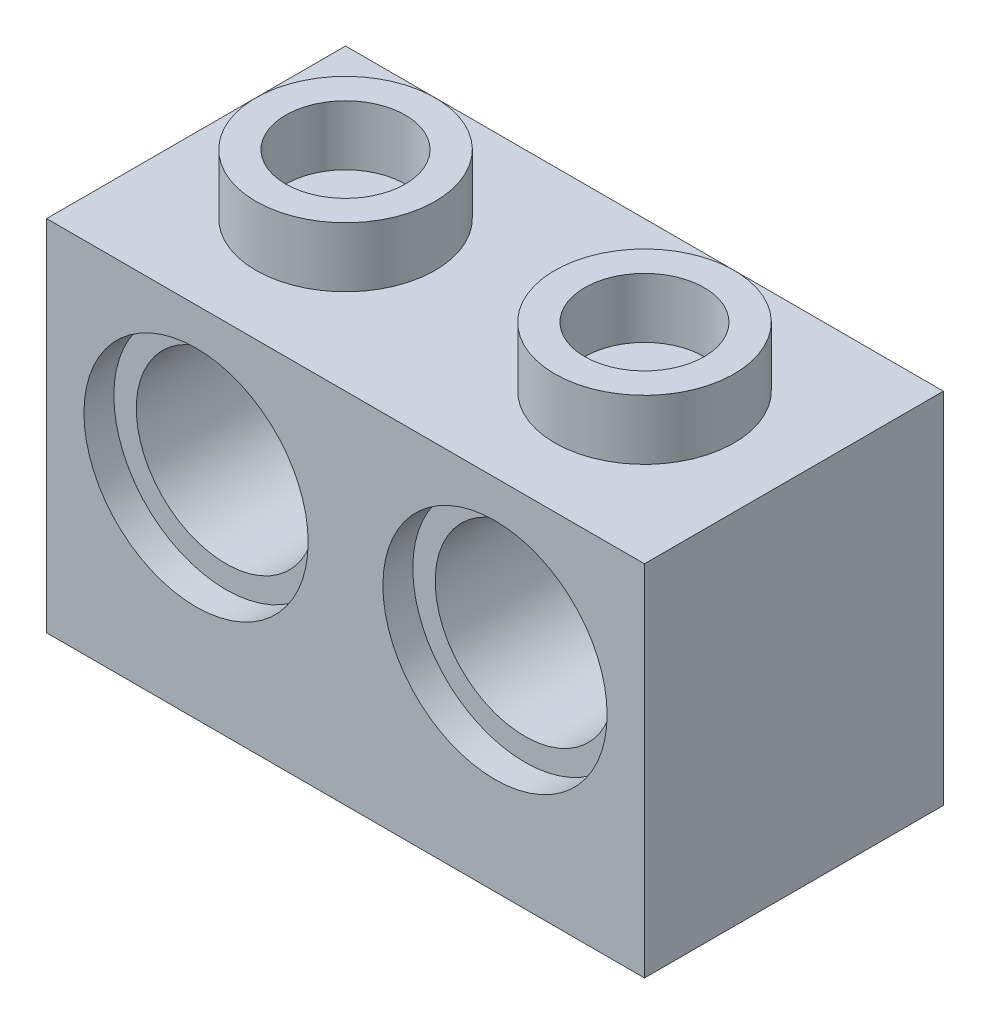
ISO-10303-21;
HEADER;
FILE_DESCRIPTION(('STEP AP214'),'2;1');
FILE_NAME('part.step','',(''),(''),'','','');
FILE_SCHEMA(('AUTOMOTIVE_DESIGN { 1 0 10303 214 1 1 1 1 }'));
ENDSEC;
DATA;
#1=APPLICATION_CONTEXT('core data for automotive mechanical design processes');
#2=APPLICATION_PROTOCOL_DEFINITION('international standard','automotive_design',2000,#1);
#3=PRODUCT_CONTEXT('',#1,'mechanical');
#4=PRODUCT('Part','Part','',(#3));
#5=PRODUCT_RELATED_PRODUCT_CATEGORY('part','',(#4));
#6=PRODUCT_DEFINITION_FORMATION('','',#4);
#7=PRODUCT_DEFINITION_CONTEXT('part definition',#1,'design');
#8=PRODUCT_DEFINITION('design','',#6,#7);
#9=PRODUCT_DEFINITION_SHAPE('','',#8);
#10=(LENGTH_UNIT() NAMED_UNIT(*) SI_UNIT(.MILLI.,.METRE.));
#11=(NAMED_UNIT(*) PLANE_ANGLE_UNIT() SI_UNIT($,.RADIAN.));
#12=(NAMED_UNIT(*) SI_UNIT($,.STERADIAN.) SOLID_ANGLE_UNIT());
#13=UNCERTAINTY_MEASURE_WITH_UNIT(LENGTH_MEASURE(1.E-05),#10,'distance_accuracy_value','');
#14=(GEOMETRIC_REPRESENTATION_CONTEXT(3) GLOBAL_UNCERTAINTY_ASSIGNED_CONTEXT((#13)) GLOBAL_UNIT_ASSIGNED_CONTEXT((#10,
#11,#12)) REPRESENTATION_CONTEXT('',''));
#15=CARTESIAN_POINT('',(0.,0.,0.));
#16=DIRECTION('',(0.,0.,1.));
#17=DIRECTION('',(1.,0.,0.));
#18=AXIS2_PLACEMENT_3D('',#15,#16,#17);
#19=CARTESIAN_POINT('',(3.99999999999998,0.80000000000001,-4.));
#20=DIRECTION('',(0.,0.,1.));
#21=DIRECTION('',(1.,0.,0.));
#22=AXIS2_PLACEMENT_3D('',#19,#20,#21);
#23=CYLINDRICAL_SURFACE('',#22,2.4);
#24=CARTESIAN_POINT('',(3.99999999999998,0.80000000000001,3.2));
#25=DIRECTION('',(0.,0.,1.));
#26=DIRECTION('',(1.,0.,0.));
#27=AXIS2_PLACEMENT_3D('',#24,#25,#26);
#28=CIRCLE('',#27,2.4);
#29=CARTESIAN_POINT('',(6.39999999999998,0.80000000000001,3.2));
#30=VERTEX_POINT('',#29);
#31=EDGE_CURVE('E207',#30,#30,#28,.F.);
#32=ORIENTED_EDGE('',*,*,#31,.F.);
#33=EDGE_LOOP('',(#32));
#34=FACE_BOUND('',#33,.T.);
#35=CARTESIAN_POINT('',(3.99999999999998,0.80000000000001,-3.2));
#36=DIRECTION('',(0.,0.,-1.));
#37=DIRECTION('',(-1.,0.,0.));
#38=AXIS2_PLACEMENT_3D('',#35,#36,#37);
#39=CIRCLE('',#38,2.4);
#40=CARTESIAN_POINT('',(1.59999999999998,0.80000000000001,-3.2));
#41=VERTEX_POINT('',#40);
#42=EDGE_CURVE('E42',#41,#41,#39,.F.);
#43=ORIENTED_EDGE('',*,*,#42,.F.);
#44=EDGE_LOOP('',(#43));
#45=FACE_BOUND('',#44,.T.);
#46=ADVANCED_FACE('F38',(#34,#45),#23,.F.);
#47=CARTESIAN_POINT('',(-4.00000000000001,0.80000000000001,-4.));
#48=DIRECTION('',(0.,0.,1.));
#49=DIRECTION('',(1.,0.,0.));
#50=AXIS2_PLACEMENT_3D('',#47,#48,#49);
#51=CYLINDRICAL_SURFACE('',#50,2.4);
#52=CARTESIAN_POINT('',(-4.00000000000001,0.80000000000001,3.2));
#53=DIRECTION('',(0.,0.,1.));
#54=DIRECTION('',(1.,0.,0.));
#55=AXIS2_PLACEMENT_3D('',#52,#53,#54);
#56=CIRCLE('',#55,2.4);
#57=CARTESIAN_POINT('',(-1.60000000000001,0.80000000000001,3.2));
#58=VERTEX_POINT('',#57);
#59=EDGE_CURVE('E204',#58,#58,#56,.F.);
#60=ORIENTED_EDGE('',*,*,#59,.F.);
#61=EDGE_LOOP('',(#60));
#62=FACE_BOUND('',#61,.T.);
#63=CARTESIAN_POINT('',(-4.00000000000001,0.80000000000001,-3.2));
#64=DIRECTION('',(0.,0.,-1.));
#65=DIRECTION('',(-1.,0.,0.));
#66=AXIS2_PLACEMENT_3D('',#63,#64,#65);
#67=CIRCLE('',#66,2.4);
#68=CARTESIAN_POINT('',(-6.40000000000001,0.80000000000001,-3.2));
#69=VERTEX_POINT('',#68);
#70=EDGE_CURVE('E210',#69,#69,#67,.F.);
#71=ORIENTED_EDGE('',*,*,#70,.F.);
#72=EDGE_LOOP('',(#71));
#73=FACE_BOUND('',#72,.T.);
#74=ADVANCED_FACE('F267',(#62,#73),#51,.F.);
#75=CARTESIAN_POINT('',(7.99999999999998,-4.79999999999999,-4.));
#76=DIRECTION('',(1.,0.,0.));
#77=DIRECTION('',(0.,0.,-1.));
#78=AXIS2_PLACEMENT_3D('',#75,#76,#77);
#79=PLANE('',#78);
#80=DIRECTION('',(0.,0.,1.));
#81=VECTOR('',#80,1.);
#82=CARTESIAN_POINT('',(7.99999999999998,4.80000000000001,-4.));
#83=LINE('',#82,#81);
#84=CARTESIAN_POINT('',(7.99999999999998,4.80000000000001,-4.));
#85=VERTEX_POINT('',#84);
#86=CARTESIAN_POINT('',(7.99999999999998,4.80000000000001,4.));
#87=VERTEX_POINT('',#86);
#88=EDGE_CURVE('E195',#85,#87,#83,.T.);
#89=ORIENTED_EDGE('',*,*,#88,.T.);
#90=DIRECTION('',(0.,1.,0.));
#91=VECTOR('',#90,1.);
#92=CARTESIAN_POINT('',(7.99999999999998,-4.79999999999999,4.));
#93=LINE('',#92,#91);
#94=CARTESIAN_POINT('',(7.99999999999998,-4.79999999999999,4.));
#95=VERTEX_POINT('',#94);
#96=EDGE_CURVE('E170',#95,#87,#93,.T.);
#97=ORIENTED_EDGE('',*,*,#96,.F.);
#98=DIRECTION('',(0.,0.,1.));
#99=VECTOR('',#98,1.);
#100=CARTESIAN_POINT('',(7.99999999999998,-4.79999999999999,-4.));
#101=LINE('',#100,#99);
#102=CARTESIAN_POINT('',(7.99999999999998,-4.79999999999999,-4.));
#103=VERTEX_POINT('',#102);
#104=EDGE_CURVE('E63',#103,#95,#101,.T.);
#105=ORIENTED_EDGE('',*,*,#104,.F.);
#106=DIRECTION('',(0.,1.,0.));
#107=VECTOR('',#106,1.);
#108=CARTESIAN_POINT('',(7.99999999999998,-4.79999999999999,-4.));
#109=LINE('',#108,#107);
#110=EDGE_CURVE('E184',#103,#85,#109,.T.);
#111=ORIENTED_EDGE('',*,*,#110,.T.);
#112=EDGE_LOOP('',(#89,#97,#105,#111));
#113=FACE_BOUND('',#112,.T.);
#114=ADVANCED_FACE('F40',(#113),#79,.T.);
#115=CARTESIAN_POINT('',(-8.00000000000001,-4.79999999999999,-4.));
#116=DIRECTION('',(0.,-1.,0.));
#117=DIRECTION('',(0.,0.,-1.));
#118=AXIS2_PLACEMENT_3D('',#115,#116,#117);
#119=PLANE('',#118);
#120=DIRECTION('',(0.,0.,1.));
#121=VECTOR('',#120,1.);
#122=CARTESIAN_POINT('',(6.39999999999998,-4.79999999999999,-4.));
#123=LINE('',#122,#121);
#124=CARTESIAN_POINT('',(6.39999999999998,-4.79999999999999,-2.4));
#125=VERTEX_POINT('',#124);
#126=CARTESIAN_POINT('',(6.39999999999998,-4.79999999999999,2.4));
#127=VERTEX_POINT('',#126);
#128=EDGE_CURVE('E114',#125,#127,#123,.T.);
#129=ORIENTED_EDGE('',*,*,#128,.F.);
#130=DIRECTION('',(1.,0.,0.));
#131=VECTOR('',#130,1.);
#132=CARTESIAN_POINT('',(-8.00000000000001,-4.79999999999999,-2.4));
#133=LINE('',#132,#131);
#134=CARTESIAN_POINT('',(-6.40000000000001,-4.79999999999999,-2.4));
#135=VERTEX_POINT('',#134);
#136=EDGE_CURVE('E147',#135,#125,#133,.T.);
#137=ORIENTED_EDGE('',*,*,#136,.F.);
#138=DIRECTION('',(0.,0.,1.));
#139=VECTOR('',#138,1.);
#140=CARTESIAN_POINT('',(-6.40000000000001,-4.79999999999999,-4.));
#141=LINE('',#140,#139);
#142=CARTESIAN_POINT('',(-6.40000000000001,-4.79999999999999,2.4));
#143=VERTEX_POINT('',#142);
#144=EDGE_CURVE('E124',#135,#143,#141,.T.);
#145=ORIENTED_EDGE('',*,*,#144,.T.);
#146=DIRECTION('',(1.,0.,0.));
#147=VECTOR('',#146,1.);
#148=CARTESIAN_POINT('',(-8.00000000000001,-4.79999999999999,2.4));
#149=LINE('',#148,#147);
#150=EDGE_CURVE('E131',#143,#127,#149,.T.);
#151=ORIENTED_EDGE('',*,*,#150,.T.);
#152=EDGE_LOOP('',(#129,#137,#145,#151));
#153=FACE_BOUND('',#152,.T.);
#154=ORIENTED_EDGE('',*,*,#104,.T.);
#155=DIRECTION('',(1.,0.,0.));
#156=VECTOR('',#155,1.);
#157=CARTESIAN_POINT('',(-8.00000000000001,-4.79999999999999,4.));
#158=LINE('',#157,#156);
#159=CARTESIAN_POINT('',(-8.00000000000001,-4.79999999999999,4.));
#160=VERTEX_POINT('',#159);
#161=EDGE_CURVE('E181',#160,#95,#158,.T.);
#162=ORIENTED_EDGE('',*,*,#161,.F.);
#163=DIRECTION('',(0.,0.,1.));
#164=VECTOR('',#163,1.);
#165=CARTESIAN_POINT('',(-8.00000000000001,-4.79999999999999,-4.));
#166=LINE('',#165,#164);
#167=CARTESIAN_POINT('',(-8.00000000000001,-4.79999999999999,-4.));
#168=VERTEX_POINT('',#167);
#169=EDGE_CURVE('E197',#168,#160,#166,.T.);
#170=ORIENTED_EDGE('',*,*,#169,.F.);
#171=DIRECTION('',(1.,0.,0.));
#172=VECTOR('',#171,1.);
#173=CARTESIAN_POINT('',(-8.00000000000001,-4.79999999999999,-4.));
#174=LINE('',#173,#172);
#175=EDGE_CURVE('E192',#168,#103,#174,.T.);
#176=ORIENTED_EDGE('',*,*,#175,.T.);
#177=EDGE_LOOP('',(#154,#162,#170,#176));
#178=FACE_BOUND('',#177,.T.);
#179=ADVANCED_FACE('F139',(#153,#178),#119,.T.);
#180=CARTESIAN_POINT('',(-8.00000000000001,-4.79999999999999,-4.));
#181=DIRECTION('',(-1.,0.,0.));
#182=DIRECTION('',(0.,0.,1.));
#183=AXIS2_PLACEMENT_3D('',#180,#181,#182);
#184=PLANE('',#183);
#185=ORIENTED_EDGE('',*,*,#169,.T.);
#186=DIRECTION('',(0.,-1.,0.));
#187=VECTOR('',#186,1.);
#188=CARTESIAN_POINT('',(-8.00000000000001,-4.79999999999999,4.));
#189=LINE('',#188,#187);
#190=CARTESIAN_POINT('',(-8.00000000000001,4.80000000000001,4.));
#191=VERTEX_POINT('',#190);
#192=EDGE_CURVE('E178',#191,#160,#189,.T.);
#193=ORIENTED_EDGE('',*,*,#192,.F.);
#194=DIRECTION('',(0.,0.,1.));
#195=VECTOR('',#194,1.);
#196=CARTESIAN_POINT('',(-8.00000000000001,4.80000000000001,-4.));
#197=LINE('',#196,#195);
#198=CARTESIAN_POINT('',(-8.00000000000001,4.80000000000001,-4.));
#199=VERTEX_POINT('',#198);
#200=EDGE_CURVE('E199',#199,#191,#197,.T.);
#201=ORIENTED_EDGE('',*,*,#200,.F.);
#202=DIRECTION('',(0.,-1.,0.));
#203=VECTOR('',#202,1.);
#204=CARTESIAN_POINT('',(-8.00000000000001,-4.79999999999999,-4.));
#205=LINE('',#204,#203);
#206=EDGE_CURVE('E189',#199,#168,#205,.T.);
#207=ORIENTED_EDGE('',*,*,#206,.T.);
#208=EDGE_LOOP('',(#185,#193,#201,#207));
#209=FACE_BOUND('',#208,.T.);
#210=ADVANCED_FACE('F316',(#209),#184,.T.);
#211=CARTESIAN_POINT('',(-8.00000000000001,4.80000000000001,-4.));
#212=DIRECTION('',(0.,1.,0.));
#213=DIRECTION('',(0.,0.,1.));
#214=AXIS2_PLACEMENT_3D('',#211,#212,#213);
#215=PLANE('',#214);
#216=CARTESIAN_POINT('',(3.99999999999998,4.80000000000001,0.));
#217=DIRECTION('',(0.,1.,0.));
#218=DIRECTION('',(0.,0.,1.));
#219=AXIS2_PLACEMENT_3D('',#216,#217,#218);
#220=CIRCLE('',#219,2.4);
#221=CARTESIAN_POINT('',(3.99999999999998,4.80000000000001,2.4));
#222=VERTEX_POINT('',#221);
#223=EDGE_CURVE('E157',#222,#222,#220,.T.);
#224=ORIENTED_EDGE('',*,*,#223,.F.);
#225=EDGE_LOOP('',(#224));
#226=FACE_BOUND('',#225,.T.);
#227=CARTESIAN_POINT('',(-4.00000000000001,4.80000000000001,0.));
#228=DIRECTION('',(0.,1.,0.));
#229=DIRECTION('',(0.,0.,1.));
#230=AXIS2_PLACEMENT_3D('',#227,#228,#229);
#231=CIRCLE('',#230,2.4);
#232=CARTESIAN_POINT('',(-4.00000000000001,4.80000000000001,2.4));
#233=VERTEX_POINT('',#232);
#234=EDGE_CURVE('E166',#233,#233,#231,.T.);
#235=ORIENTED_EDGE('',*,*,#234,.F.);
#236=EDGE_LOOP('',(#235));
#237=FACE_BOUND('',#236,.T.);
#238=ORIENTED_EDGE('',*,*,#200,.T.);
#239=DIRECTION('',(-1.,0.,0.));
#240=VECTOR('',#239,1.);
#241=CARTESIAN_POINT('',(-8.00000000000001,4.80000000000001,4.));
#242=LINE('',#241,#240);
#243=EDGE_CURVE('E175',#87,#191,#242,.T.);
#244=ORIENTED_EDGE('',*,*,#243,.F.);
#245=ORIENTED_EDGE('',*,*,#88,.F.);
#246=DIRECTION('',(-1.,0.,0.));
#247=VECTOR('',#246,1.);
#248=CARTESIAN_POINT('',(-8.00000000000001,4.80000000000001,-4.));
#249=LINE('',#248,#247);
#250=EDGE_CURVE('E186',#85,#199,#249,.T.);
#251=ORIENTED_EDGE('',*,*,#250,.T.);
#252=EDGE_LOOP('',(#238,#244,#245,#251));
#253=FACE_BOUND('',#252,.T.);
#254=ADVANCED_FACE('F312',(#226,#237,#253),#215,.T.);
#255=CARTESIAN_POINT('',(0.,0.,-4.));
#256=DIRECTION('',(0.,0.,-1.));
#257=DIRECTION('',(-1.,0.,0.));
#258=AXIS2_PLACEMENT_3D('',#255,#256,#257);
#259=PLANE('',#258);
#260=CARTESIAN_POINT('',(-4.00000000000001,0.80000000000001,-4.));
#261=DIRECTION('',(0.,0.,1.));
#262=DIRECTION('',(1.,0.,0.));
#263=AXIS2_PLACEMENT_3D('',#260,#261,#262);
#264=CIRCLE('',#263,3.);
#265=CARTESIAN_POINT('',(-1.00000000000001,0.80000000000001,-4.));
#266=VERTEX_POINT('',#265);
#267=EDGE_CURVE('E218',#266,#266,#264,.T.);
#268=ORIENTED_EDGE('',*,*,#267,.T.);
#269=EDGE_LOOP('',(#268));
#270=FACE_BOUND('',#269,.T.);
#271=CARTESIAN_POINT('',(3.99999999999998,0.80000000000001,-4.));
#272=DIRECTION('',(0.,0.,1.));
#273=DIRECTION('',(1.,0.,0.));
#274=AXIS2_PLACEMENT_3D('',#271,#272,#273);
#275=CIRCLE('',#274,3.);
#276=CARTESIAN_POINT('',(6.99999999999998,0.80000000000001,-4.));
#277=VERTEX_POINT('',#276);
#278=EDGE_CURVE('E228',#277,#277,#275,.T.);
#279=ORIENTED_EDGE('',*,*,#278,.T.);
#280=EDGE_LOOP('',(#279));
#281=FACE_BOUND('',#280,.T.);
#282=ORIENTED_EDGE('',*,*,#110,.F.);
#283=ORIENTED_EDGE('',*,*,#175,.F.);
#284=ORIENTED_EDGE('',*,*,#206,.F.);
#285=ORIENTED_EDGE('',*,*,#250,.F.);
#286=EDGE_LOOP('',(#282,#283,#284,#285));
#287=FACE_BOUND('',#286,.T.);
#288=ADVANCED_FACE('F308',(#270,#281,#287),#259,.T.);
#289=CARTESIAN_POINT('',(0.,0.,4.));
#290=DIRECTION('',(0.,0.,-1.));
#291=DIRECTION('',(-1.,0.,0.));
#292=AXIS2_PLACEMENT_3D('',#289,#290,#291);
#293=PLANE('',#292);
#294=CARTESIAN_POINT('',(-4.00000000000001,0.80000000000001,4.));
#295=DIRECTION('',(0.,0.,1.));
#296=DIRECTION('',(1.,0.,0.));
#297=AXIS2_PLACEMENT_3D('',#294,#295,#296);
#298=CIRCLE('',#297,3.);
#299=CARTESIAN_POINT('',(-1.00000000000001,0.80000000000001,4.));
#300=VERTEX_POINT('',#299);
#301=EDGE_CURVE('E233',#300,#300,#298,.T.);
#302=ORIENTED_EDGE('',*,*,#301,.F.);
#303=EDGE_LOOP('',(#302));
#304=FACE_BOUND('',#303,.T.);
#305=CARTESIAN_POINT('',(3.99999999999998,0.80000000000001,4.));
#306=DIRECTION('',(0.,0.,1.));
#307=DIRECTION('',(1.,0.,0.));
#308=AXIS2_PLACEMENT_3D('',#305,#306,#307);
#309=CIRCLE('',#308,3.);
#310=CARTESIAN_POINT('',(6.99999999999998,0.80000000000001,4.));
#311=VERTEX_POINT('',#310);
#312=EDGE_CURVE('E216',#311,#311,#309,.T.);
#313=ORIENTED_EDGE('',*,*,#312,.F.);
#314=EDGE_LOOP('',(#313));
#315=FACE_BOUND('',#314,.T.);
#316=ORIENTED_EDGE('',*,*,#96,.T.);
#317=ORIENTED_EDGE('',*,*,#243,.T.);
#318=ORIENTED_EDGE('',*,*,#192,.T.);
#319=ORIENTED_EDGE('',*,*,#161,.T.);
#320=EDGE_LOOP('',(#316,#317,#318,#319));
#321=FACE_BOUND('',#320,.T.);
#322=ADVANCED_FACE('F301',(#304,#315,#321),#293,.F.);
#323=CARTESIAN_POINT('',(-4.00000000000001,6.40000000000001,0.));
#324=DIRECTION('',(0.,1.,0.));
#325=DIRECTION('',(0.,0.,1.));
#326=AXIS2_PLACEMENT_3D('',#323,#324,#325);
#327=PLANE('',#326);
#328=CARTESIAN_POINT('',(-4.00000000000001,6.40000000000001,0.));
#329=DIRECTION('',(0.,1.,0.));
#330=DIRECTION('',(0.,0.,1.));
#331=AXIS2_PLACEMENT_3D('',#328,#329,#330);
#332=CIRCLE('',#331,2.4);
#333=CARTESIAN_POINT('',(-4.00000000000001,6.40000000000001,2.4));
#334=VERTEX_POINT('',#333);
#335=EDGE_CURVE('E167',#334,#334,#332,.T.);
#336=ORIENTED_EDGE('',*,*,#335,.T.);
#337=EDGE_LOOP('',(#336));
#338=FACE_BOUND('',#337,.T.);
#339=CARTESIAN_POINT('',(-4.00000000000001,6.40000000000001,0.));
#340=DIRECTION('',(0.,1.,0.));
#341=DIRECTION('',(0.,0.,1.));
#342=AXIS2_PLACEMENT_3D('',#339,#340,#341);
#343=CIRCLE('',#342,1.6);
#344=CARTESIAN_POINT('',(-4.00000000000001,6.40000000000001,1.6));
#345=VERTEX_POINT('',#344);
#346=EDGE_CURVE('E161',#345,#345,#343,.T.);
#347=ORIENTED_EDGE('',*,*,#346,.F.);
#348=EDGE_LOOP('',(#347));
#349=FACE_BOUND('',#348,.T.);
#350=ADVANCED_FACE('F298',(#338,#349),#327,.T.);
#351=CARTESIAN_POINT('',(-4.00000000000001,6.40000000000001,0.));
#352=DIRECTION('',(0.,-1.,0.));
#353=DIRECTION('',(0.,0.,-1.));
#354=AXIS2_PLACEMENT_3D('',#351,#352,#353);
#355=CYLINDRICAL_SURFACE('',#354,2.4);
#356=ORIENTED_EDGE('',*,*,#335,.F.);
#357=EDGE_LOOP('',(#356));
#358=FACE_BOUND('',#357,.T.);
#359=ORIENTED_EDGE('',*,*,#234,.T.);
#360=EDGE_LOOP('',(#359));
#361=FACE_BOUND('',#360,.T.);
#362=ADVANCED_FACE('F296',(#358,#361),#355,.T.);
#363=CARTESIAN_POINT('',(-4.00000000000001,6.40000000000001,0.));
#364=DIRECTION('',(0.,-1.,0.));
#365=DIRECTION('',(0.,0.,-1.));
#366=AXIS2_PLACEMENT_3D('',#363,#364,#365);
#367=CYLINDRICAL_SURFACE('',#366,1.6);
#368=ORIENTED_EDGE('',*,*,#346,.T.);
#369=EDGE_LOOP('',(#368));
#370=FACE_BOUND('',#369,.T.);
#371=CARTESIAN_POINT('',(-4.00000000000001,4.80000000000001,0.));
#372=DIRECTION('',(0.,1.,0.));
#373=DIRECTION('',(0.,0.,1.));
#374=AXIS2_PLACEMENT_3D('',#371,#372,#373);
#375=CIRCLE('',#374,1.6);
#376=CARTESIAN_POINT('',(-4.00000000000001,4.80000000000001,1.6));
#377=VERTEX_POINT('',#376);
#378=EDGE_CURVE('E47',#377,#377,#375,.F.);
#379=ORIENTED_EDGE('',*,*,#378,.T.);
#380=EDGE_LOOP('',(#379));
#381=FACE_BOUND('',#380,.T.);
#382=ADVANCED_FACE('F293',(#370,#381),#367,.F.);
#383=ORIENTED_EDGE('',*,*,#378,.F.);
#384=EDGE_LOOP('',(#383));
#385=FACE_BOUND('',#384,.T.);
#386=ADVANCED_FACE('F288',(#385),#215,.T.);
#387=CARTESIAN_POINT('',(3.99999999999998,6.40000000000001,0.));
#388=DIRECTION('',(0.,1.,0.));
#389=DIRECTION('',(0.,0.,1.));
#390=AXIS2_PLACEMENT_3D('',#387,#388,#389);
#391=PLANE('',#390);
#392=CARTESIAN_POINT('',(3.99999999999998,6.40000000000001,0.));
#393=DIRECTION('',(0.,1.,0.));
#394=DIRECTION('',(0.,0.,1.));
#395=AXIS2_PLACEMENT_3D('',#392,#393,#394);
#396=CIRCLE('',#395,2.4);
#397=CARTESIAN_POINT('',(3.99999999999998,6.40000000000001,2.4));
#398=VERTEX_POINT('',#397);
#399=EDGE_CURVE('E158',#398,#398,#396,.T.);
#400=ORIENTED_EDGE('',*,*,#399,.T.);
#401=EDGE_LOOP('',(#400));
#402=FACE_BOUND('',#401,.T.);
#403=CARTESIAN_POINT('',(3.99999999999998,6.40000000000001,0.));
#404=DIRECTION('',(0.,1.,0.));
#405=DIRECTION('',(0.,0.,1.));
#406=AXIS2_PLACEMENT_3D('',#403,#404,#405);
#407=CIRCLE('',#406,1.6);
#408=CARTESIAN_POINT('',(3.99999999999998,6.40000000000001,1.6));
#409=VERTEX_POINT('',#408);
#410=EDGE_CURVE('E154',#409,#409,#407,.T.);
#411=ORIENTED_EDGE('',*,*,#410,.F.);
#412=EDGE_LOOP('',(#411));
#413=FACE_BOUND('',#412,.T.);
#414=ADVANCED_FACE('F285',(#402,#413),#391,.T.);
#415=CARTESIAN_POINT('',(3.99999999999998,6.40000000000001,0.));
#416=DIRECTION('',(0.,-1.,0.));
#417=DIRECTION('',(0.,0.,-1.));
#418=AXIS2_PLACEMENT_3D('',#415,#416,#417);
#419=CYLINDRICAL_SURFACE('',#418,2.4);
#420=ORIENTED_EDGE('',*,*,#399,.F.);
#421=EDGE_LOOP('',(#420));
#422=FACE_BOUND('',#421,.T.);
#423=ORIENTED_EDGE('',*,*,#223,.T.);
#424=EDGE_LOOP('',(#423));
#425=FACE_BOUND('',#424,.T.);
#426=ADVANCED_FACE('F283',(#422,#425),#419,.T.);
#427=CARTESIAN_POINT('',(3.99999999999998,6.40000000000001,0.));
#428=DIRECTION('',(0.,-1.,0.));
#429=DIRECTION('',(0.,0.,-1.));
#430=AXIS2_PLACEMENT_3D('',#427,#428,#429);
#431=CYLINDRICAL_SURFACE('',#430,1.6);
#432=ORIENTED_EDGE('',*,*,#410,.T.);
#433=EDGE_LOOP('',(#432));
#434=FACE_BOUND('',#433,.T.);
#435=CARTESIAN_POINT('',(3.99999999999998,4.80000000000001,0.));
#436=DIRECTION('',(0.,1.,0.));
#437=DIRECTION('',(0.,0.,1.));
#438=AXIS2_PLACEMENT_3D('',#435,#436,#437);
#439=CIRCLE('',#438,1.6);
#440=CARTESIAN_POINT('',(3.99999999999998,4.80000000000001,1.6));
#441=VERTEX_POINT('',#440);
#442=EDGE_CURVE('E11',#441,#441,#439,.F.);
#443=ORIENTED_EDGE('',*,*,#442,.T.);
#444=EDGE_LOOP('',(#443));
#445=FACE_BOUND('',#444,.T.);
#446=ADVANCED_FACE('F279',(#434,#445),#431,.F.);
#447=ORIENTED_EDGE('',*,*,#442,.F.);
#448=EDGE_LOOP('',(#447));
#449=FACE_BOUND('',#448,.T.);
#450=ADVANCED_FACE('F282',(#449),#215,.T.);
#451=CARTESIAN_POINT('',(0.,0.,2.4));
#452=DIRECTION('',(0.,0.,-1.));
#453=DIRECTION('',(-1.,0.,0.));
#454=AXIS2_PLACEMENT_3D('',#451,#452,#453);
#455=PLANE('',#454);
#456=DIRECTION('',(0.,1.,0.));
#457=VECTOR('',#456,1.);
#458=CARTESIAN_POINT('',(6.39999999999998,-4.79999999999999,2.4));
#459=LINE('',#458,#457);
#460=CARTESIAN_POINT('',(6.39999999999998,-2.39999999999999,2.4));
#461=VERTEX_POINT('',#460);
#462=EDGE_CURVE('E117',#127,#461,#459,.T.);
#463=ORIENTED_EDGE('',*,*,#462,.F.);
#464=ORIENTED_EDGE('',*,*,#150,.F.);
#465=DIRECTION('',(0.,-1.,0.));
#466=VECTOR('',#465,1.);
#467=CARTESIAN_POINT('',(-6.40000000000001,-4.79999999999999,2.4));
#468=LINE('',#467,#466);
#469=CARTESIAN_POINT('',(-6.40000000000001,-2.39999999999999,2.4));
#470=VERTEX_POINT('',#469);
#471=EDGE_CURVE('E136',#470,#143,#468,.T.);
#472=ORIENTED_EDGE('',*,*,#471,.F.);
#473=CARTESIAN_POINT('',(-4.00000000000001,0.80000000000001,2.4));
#474=DIRECTION('',(0.,0.,-1.));
#475=DIRECTION('',(-1.,0.,0.));
#476=AXIS2_PLACEMENT_3D('',#473,#474,#475);
#477=CIRCLE('',#476,4.);
#478=CARTESIAN_POINT('',(0.,0.80000000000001,2.4));
#479=VERTEX_POINT('',#478);
#480=EDGE_CURVE('E244',#470,#479,#477,.F.);
#481=ORIENTED_EDGE('',*,*,#480,.T.);
#482=CARTESIAN_POINT('',(3.99999999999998,0.80000000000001,2.4));
#483=DIRECTION('',(0.,0.,-1.));
#484=DIRECTION('',(-1.,0.,0.));
#485=AXIS2_PLACEMENT_3D('',#482,#483,#484);
#486=CIRCLE('',#485,4.);
#487=EDGE_CURVE('E135',#479,#461,#486,.F.);
#488=ORIENTED_EDGE('',*,*,#487,.T.);
#489=EDGE_LOOP('',(#463,#464,#472,#481,#488));
#490=FACE_BOUND('',#489,.T.);
#491=ADVANCED_FACE('F129',(#490),#455,.T.);
#492=CARTESIAN_POINT('',(0.,0.,-2.4));
#493=DIRECTION('',(0.,0.,-1.));
#494=DIRECTION('',(-1.,0.,0.));
#495=AXIS2_PLACEMENT_3D('',#492,#493,#494);
#496=PLANE('',#495);
#497=CARTESIAN_POINT('',(3.99999999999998,0.80000000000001,-2.4));
#498=DIRECTION('',(0.,0.,-1.));
#499=DIRECTION('',(-1.,0.,0.));
#500=AXIS2_PLACEMENT_3D('',#497,#498,#499);
#501=CIRCLE('',#500,4.);
#502=CARTESIAN_POINT('',(0.,0.80000000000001,-2.4));
#503=VERTEX_POINT('',#502);
#504=CARTESIAN_POINT('',(6.39999999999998,-2.39999999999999,-2.4));
#505=VERTEX_POINT('',#504);
#506=EDGE_CURVE('E245',#503,#505,#501,.F.);
#507=ORIENTED_EDGE('',*,*,#506,.F.);
#508=CARTESIAN_POINT('',(-4.00000000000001,0.80000000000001,-2.4));
#509=DIRECTION('',(0.,0.,-1.));
#510=DIRECTION('',(-1.,0.,0.));
#511=AXIS2_PLACEMENT_3D('',#508,#509,#510);
#512=CIRCLE('',#511,4.);
#513=CARTESIAN_POINT('',(-6.40000000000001,-2.39999999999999,-2.4));
#514=VERTEX_POINT('',#513);
#515=EDGE_CURVE('E137',#514,#503,#512,.F.);
#516=ORIENTED_EDGE('',*,*,#515,.F.);
#517=DIRECTION('',(0.,-1.,0.));
#518=VECTOR('',#517,1.);
#519=CARTESIAN_POINT('',(-6.40000000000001,-4.79999999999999,-2.4));
#520=LINE('',#519,#518);
#521=EDGE_CURVE('E55',#514,#135,#520,.T.);
#522=ORIENTED_EDGE('',*,*,#521,.T.);
#523=ORIENTED_EDGE('',*,*,#136,.T.);
#524=DIRECTION('',(0.,1.,0.));
#525=VECTOR('',#524,1.);
#526=CARTESIAN_POINT('',(6.39999999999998,-4.79999999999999,-2.4));
#527=LINE('',#526,#525);
#528=EDGE_CURVE('E119',#125,#505,#527,.T.);
#529=ORIENTED_EDGE('',*,*,#528,.T.);
#530=EDGE_LOOP('',(#507,#516,#522,#523,#529));
#531=FACE_BOUND('',#530,.T.);
#532=ADVANCED_FACE('F254',(#531),#496,.F.);
#533=CARTESIAN_POINT('',(6.39999999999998,-4.79999999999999,-4.));
#534=DIRECTION('',(1.,0.,0.));
#535=DIRECTION('',(0.,0.,-1.));
#536=AXIS2_PLACEMENT_3D('',#533,#534,#535);
#537=PLANE('',#536);
#538=ORIENTED_EDGE('',*,*,#528,.F.);
#539=ORIENTED_EDGE('',*,*,#128,.T.);
#540=ORIENTED_EDGE('',*,*,#462,.T.);
#541=DIRECTION('',(0.,0.,1.));
#542=VECTOR('',#541,1.);
#543=CARTESIAN_POINT('',(6.39999999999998,-2.39999999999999,-4.));
#544=LINE('',#543,#542);
#545=EDGE_CURVE('E123',#505,#461,#544,.T.);
#546=ORIENTED_EDGE('',*,*,#545,.F.);
#547=EDGE_LOOP('',(#538,#539,#540,#546));
#548=FACE_BOUND('',#547,.T.);
#549=ADVANCED_FACE('F116',(#548),#537,.F.);
#550=CARTESIAN_POINT('',(-6.40000000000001,-4.79999999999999,-4.));
#551=DIRECTION('',(-1.,0.,0.));
#552=DIRECTION('',(0.,0.,1.));
#553=AXIS2_PLACEMENT_3D('',#550,#551,#552);
#554=PLANE('',#553);
#555=DIRECTION('',(0.,0.,1.));
#556=VECTOR('',#555,1.);
#557=CARTESIAN_POINT('',(-6.40000000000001,-2.39999999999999,-4.));
#558=LINE('',#557,#556);
#559=EDGE_CURVE('E150',#514,#470,#558,.T.);
#560=ORIENTED_EDGE('',*,*,#559,.T.);
#561=ORIENTED_EDGE('',*,*,#471,.T.);
#562=ORIENTED_EDGE('',*,*,#144,.F.);
#563=ORIENTED_EDGE('',*,*,#521,.F.);
#564=EDGE_LOOP('',(#560,#561,#562,#563));
#565=FACE_BOUND('',#564,.T.);
#566=ADVANCED_FACE('F256',(#565),#554,.F.);
#567=CARTESIAN_POINT('',(3.99999999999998,0.80000000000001,-4.));
#568=DIRECTION('',(0.,0.,1.));
#569=DIRECTION('',(1.,0.,0.));
#570=AXIS2_PLACEMENT_3D('',#567,#568,#569);
#571=CYLINDRICAL_SURFACE('',#570,4.);
#572=ORIENTED_EDGE('',*,*,#506,.T.);
#573=ORIENTED_EDGE('',*,*,#545,.T.);
#574=ORIENTED_EDGE('',*,*,#487,.F.);
#575=DIRECTION('',(0.,0.,1.));
#576=VECTOR('',#575,1.);
#577=CARTESIAN_POINT('',(0.,0.80000000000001,-4.));
#578=LINE('',#577,#576);
#579=EDGE_CURVE('E152',#503,#479,#578,.T.);
#580=ORIENTED_EDGE('',*,*,#579,.F.);
#581=EDGE_LOOP('',(#572,#573,#574,#580));
#582=FACE_BOUND('',#581,.T.);
#583=ADVANCED_FACE('F253',(#582),#571,.T.);
#584=CARTESIAN_POINT('',(-4.00000000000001,0.80000000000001,-4.));
#585=DIRECTION('',(0.,0.,1.));
#586=DIRECTION('',(1.,0.,0.));
#587=AXIS2_PLACEMENT_3D('',#584,#585,#586);
#588=CYLINDRICAL_SURFACE('',#587,4.);
#589=ORIENTED_EDGE('',*,*,#579,.T.);
#590=ORIENTED_EDGE('',*,*,#480,.F.);
#591=ORIENTED_EDGE('',*,*,#559,.F.);
#592=ORIENTED_EDGE('',*,*,#515,.T.);
#593=EDGE_LOOP('',(#589,#590,#591,#592));
#594=FACE_BOUND('',#593,.T.);
#595=ADVANCED_FACE('F250',(#594),#588,.T.);
#596=CARTESIAN_POINT('',(-4.00000000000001,0.80000000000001,3.2));
#597=DIRECTION('',(0.,0.,1.));
#598=DIRECTION('',(1.,0.,0.));
#599=AXIS2_PLACEMENT_3D('',#596,#597,#598);
#600=PLANE('',#599);
#601=CARTESIAN_POINT('',(-4.00000000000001,0.80000000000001,3.2));
#602=DIRECTION('',(0.,0.,1.));
#603=DIRECTION('',(1.,0.,0.));
#604=AXIS2_PLACEMENT_3D('',#601,#602,#603);
#605=CIRCLE('',#604,3.);
#606=CARTESIAN_POINT('',(-1.00000000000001,0.80000000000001,3.2));
#607=VERTEX_POINT('',#606);
#608=EDGE_CURVE('E208',#607,#607,#605,.T.);
#609=ORIENTED_EDGE('',*,*,#608,.T.);
#610=EDGE_LOOP('',(#609));
#611=FACE_BOUND('',#610,.T.);
#612=ORIENTED_EDGE('',*,*,#59,.T.);
#613=EDGE_LOOP('',(#612));
#614=FACE_BOUND('',#613,.T.);
#615=ADVANCED_FACE('F388',(#611,#614),#600,.T.);
#616=CARTESIAN_POINT('',(-4.00000000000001,0.80000000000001,3.2));
#617=DIRECTION('',(0.,0.,1.));
#618=DIRECTION('',(1.,0.,0.));
#619=AXIS2_PLACEMENT_3D('',#616,#617,#618);
#620=CYLINDRICAL_SURFACE('',#619,3.);
#621=ORIENTED_EDGE('',*,*,#608,.F.);
#622=EDGE_LOOP('',(#621));
#623=FACE_BOUND('',#622,.T.);
#624=ORIENTED_EDGE('',*,*,#301,.T.);
#625=EDGE_LOOP('',(#624));
#626=FACE_BOUND('',#625,.T.);
#627=ADVANCED_FACE('F405',(#623,#626),#620,.F.);
#628=CARTESIAN_POINT('',(3.99999999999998,0.80000000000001,3.2));
#629=DIRECTION('',(0.,0.,1.));
#630=DIRECTION('',(1.,0.,0.));
#631=AXIS2_PLACEMENT_3D('',#628,#629,#630);
#632=PLANE('',#631);
#633=CARTESIAN_POINT('',(3.99999999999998,0.80000000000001,3.2));
#634=DIRECTION('',(0.,0.,1.));
#635=DIRECTION('',(1.,0.,0.));
#636=AXIS2_PLACEMENT_3D('',#633,#634,#635);
#637=CIRCLE('',#636,3.);
#638=CARTESIAN_POINT('',(6.99999999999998,0.80000000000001,3.2));
#639=VERTEX_POINT('',#638);
#640=EDGE_CURVE('E236',#639,#639,#637,.T.);
#641=ORIENTED_EDGE('',*,*,#640,.T.);
#642=EDGE_LOOP('',(#641));
#643=FACE_BOUND('',#642,.T.);
#644=ORIENTED_EDGE('',*,*,#31,.T.);
#645=EDGE_LOOP('',(#644));
#646=FACE_BOUND('',#645,.T.);
#647=ADVANCED_FACE('F415',(#643,#646),#632,.T.);
#648=CARTESIAN_POINT('',(3.99999999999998,0.80000000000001,3.2));
#649=DIRECTION('',(0.,0.,1.));
#650=DIRECTION('',(1.,0.,0.));
#651=AXIS2_PLACEMENT_3D('',#648,#649,#650);
#652=CYLINDRICAL_SURFACE('',#651,3.);
#653=ORIENTED_EDGE('',*,*,#640,.F.);
#654=EDGE_LOOP('',(#653));
#655=FACE_BOUND('',#654,.T.);
#656=ORIENTED_EDGE('',*,*,#312,.T.);
#657=EDGE_LOOP('',(#656));
#658=FACE_BOUND('',#657,.T.);
#659=ADVANCED_FACE('F425',(#655,#658),#652,.F.);
#660=CARTESIAN_POINT('',(3.99999999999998,0.80000000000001,-3.2));
#661=DIRECTION('',(0.,0.,-1.));
#662=DIRECTION('',(1.,0.,0.));
#663=AXIS2_PLACEMENT_3D('',#660,#661,#662);
#664=PLANE('',#663);
#665=CARTESIAN_POINT('',(3.99999999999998,0.80000000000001,-3.2));
#666=DIRECTION('',(0.,0.,1.));
#667=DIRECTION('',(1.,0.,0.));
#668=AXIS2_PLACEMENT_3D('',#665,#666,#667);
#669=CIRCLE('',#668,3.);
#670=CARTESIAN_POINT('',(6.99999999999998,0.80000000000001,-3.2));
#671=VERTEX_POINT('',#670);
#672=EDGE_CURVE('E223',#671,#671,#669,.T.);
#673=ORIENTED_EDGE('',*,*,#672,.F.);
#674=EDGE_LOOP('',(#673));
#675=FACE_BOUND('',#674,.T.);
#676=ORIENTED_EDGE('',*,*,#42,.T.);
#677=EDGE_LOOP('',(#676));
#678=FACE_BOUND('',#677,.T.);
#679=ADVANCED_FACE('F434',(#675,#678),#664,.T.);
#680=CARTESIAN_POINT('',(3.99999999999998,0.80000000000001,-3.2));
#681=DIRECTION('',(0.,0.,-1.));
#682=DIRECTION('',(-1.,0.,0.));
#683=AXIS2_PLACEMENT_3D('',#680,#681,#682);
#684=CYLINDRICAL_SURFACE('',#683,3.);
#685=ORIENTED_EDGE('',*,*,#672,.T.);
#686=EDGE_LOOP('',(#685));
#687=FACE_BOUND('',#686,.T.);
#688=ORIENTED_EDGE('',*,*,#278,.F.);
#689=EDGE_LOOP('',(#688));
#690=FACE_BOUND('',#689,.T.);
#691=ADVANCED_FACE('F462',(#687,#690),#684,.F.);
#692=CARTESIAN_POINT('',(-4.00000000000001,0.80000000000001,-3.2));
#693=DIRECTION('',(0.,0.,-1.));
#694=DIRECTION('',(1.,0.,0.));
#695=AXIS2_PLACEMENT_3D('',#692,#693,#694);
#696=PLANE('',#695);
#697=CARTESIAN_POINT('',(-4.00000000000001,0.80000000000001,-3.2));
#698=DIRECTION('',(0.,0.,1.));
#699=DIRECTION('',(1.,0.,0.));
#700=AXIS2_PLACEMENT_3D('',#697,#698,#699);
#701=CIRCLE('',#700,3.);
#702=CARTESIAN_POINT('',(-1.00000000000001,0.80000000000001,-3.2));
#703=VERTEX_POINT('',#702);
#704=EDGE_CURVE('E212',#703,#703,#701,.T.);
#705=ORIENTED_EDGE('',*,*,#704,.F.);
#706=EDGE_LOOP('',(#705));
#707=FACE_BOUND('',#706,.T.);
#708=ORIENTED_EDGE('',*,*,#70,.T.);
#709=EDGE_LOOP('',(#708));
#710=FACE_BOUND('',#709,.T.);
#711=ADVANCED_FACE('F472',(#707,#710),#696,.T.);
#712=CARTESIAN_POINT('',(-4.00000000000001,0.80000000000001,-3.2));
#713=DIRECTION('',(0.,0.,-1.));
#714=DIRECTION('',(-1.,0.,0.));
#715=AXIS2_PLACEMENT_3D('',#712,#713,#714);
#716=CYLINDRICAL_SURFACE('',#715,3.);
#717=ORIENTED_EDGE('',*,*,#704,.T.);
#718=EDGE_LOOP('',(#717));
#719=FACE_BOUND('',#718,.T.);
#720=ORIENTED_EDGE('',*,*,#267,.F.);
#721=EDGE_LOOP('',(#720));
#722=FACE_BOUND('',#721,.T.);
#723=ADVANCED_FACE('F482',(#719,#722),#716,.F.);
#724=CLOSED_SHELL('',(#46,#74,#114,#179,#210,#254,#288,#322,#350,#362,#382,#386,#414,#426,#446,
#450,#491,#532,#549,#566,#583,#595,#615,#627,#647,#659,#679,#691,#711,#723));
#725=MANIFOLD_SOLID_BREP('B2',#724);
#726=ADVANCED_BREP_SHAPE_REPRESENTATION('',(#18,#725),#14);
#727=SHAPE_DEFINITION_REPRESENTATION(#9,#726);
ENDSEC;
END-ISO-10303-21;
